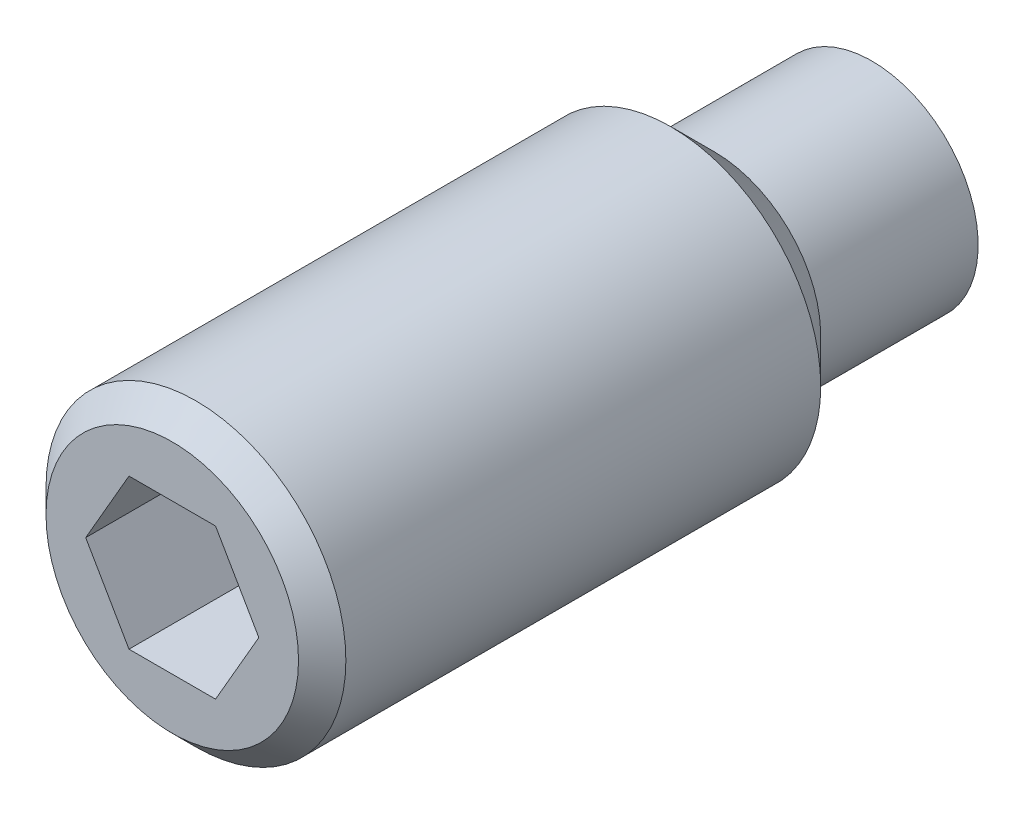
ISO-10303-21;
HEADER;
FILE_DESCRIPTION(('STEP AP214'),'2;1');
FILE_NAME('part.step','',(''),(''),'','','');
FILE_SCHEMA(('AUTOMOTIVE_DESIGN { 1 0 10303 214 1 1 1 1 }'));
ENDSEC;
DATA;
#1=APPLICATION_CONTEXT('core data for automotive mechanical design processes');
#2=APPLICATION_PROTOCOL_DEFINITION('international standard','automotive_design',2000,#1);
#3=PRODUCT_CONTEXT('',#1,'mechanical');
#4=PRODUCT('Part','Part','',(#3));
#5=PRODUCT_RELATED_PRODUCT_CATEGORY('part','',(#4));
#6=PRODUCT_DEFINITION_FORMATION('','',#4);
#7=PRODUCT_DEFINITION_CONTEXT('part definition',#1,'design');
#8=PRODUCT_DEFINITION('design','',#6,#7);
#9=PRODUCT_DEFINITION_SHAPE('','',#8);
#10=(LENGTH_UNIT() NAMED_UNIT(*) SI_UNIT(.MILLI.,.METRE.));
#11=(NAMED_UNIT(*) PLANE_ANGLE_UNIT() SI_UNIT($,.RADIAN.));
#12=(NAMED_UNIT(*) SI_UNIT($,.STERADIAN.) SOLID_ANGLE_UNIT());
#13=UNCERTAINTY_MEASURE_WITH_UNIT(LENGTH_MEASURE(1.E-05),#10,'distance_accuracy_value','');
#14=(GEOMETRIC_REPRESENTATION_CONTEXT(3) GLOBAL_UNCERTAINTY_ASSIGNED_CONTEXT((#13)) GLOBAL_UNIT_ASSIGNED_CONTEXT((#10,
#11,#12)) REPRESENTATION_CONTEXT('',''));
#15=CARTESIAN_POINT('',(0.,0.,0.));
#16=DIRECTION('',(0.,0.,1.));
#17=DIRECTION('',(1.,0.,0.));
#18=AXIS2_PLACEMENT_3D('',#15,#16,#17);
#19=CARTESIAN_POINT('',(0.,0.,-7.98800000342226));
#20=DIRECTION('',(0.,0.,1.));
#21=DIRECTION('',(1.,0.,0.));
#22=AXIS2_PLACEMENT_3D('',#19,#20,#21);
#23=CONICAL_SURFACE('',#22,3.48488459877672,1.04719755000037);
#24=CARTESIAN_POINT('',(3.46410000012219,8.40244162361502E-10,-7.9999999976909));
#25=CARTESIAN_POINT('',(3.38798689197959,0.131831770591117,-8.04395665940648));
#26=CARTESIAN_POINT('',(3.31121677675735,0.264801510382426,-8.08393294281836));
#27=CARTESIAN_POINT('',(3.15634732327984,0.533043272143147,-8.15371034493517));
#28=CARTESIAN_POINT('',(3.07824523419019,0.668320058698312,-8.18348678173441));
#29=CARTESIAN_POINT('',(2.92300893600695,0.937197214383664,-8.22983595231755));
#30=CARTESIAN_POINT('',(2.84589860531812,1.07075622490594,-8.2467172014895));
#31=CARTESIAN_POINT('',(2.69131530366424,1.33850235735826,-8.26686612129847));
#32=CARTESIAN_POINT('',(2.61384289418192,1.47268850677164,-8.27015048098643));
#33=CARTESIAN_POINT('',(2.46909400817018,1.72340093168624,-8.2633004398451));
#34=CARTESIAN_POINT('',(2.40179581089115,1.83996482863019,-8.25484795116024));
#35=CARTESIAN_POINT('',(2.26763784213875,2.07233324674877,-8.22806394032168));
#36=CARTESIAN_POINT('',(2.20077853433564,2.18813696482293,-8.20972327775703));
#37=CARTESIAN_POINT('',(2.06634418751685,2.42098408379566,-8.16387517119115));
#38=CARTESIAN_POINT('',(1.9987861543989,2.53799802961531,-8.13617347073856));
#39=CARTESIAN_POINT('',(1.8646774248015,2.7702811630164,-8.07330232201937));
#40=CARTESIAN_POINT('',(1.79812501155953,2.88555332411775,-8.03814763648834));
#41=CARTESIAN_POINT('',(1.73205000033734,2.99999860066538,-7.99999999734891));
#42=B_SPLINE_CURVE_WITH_KNOTS('',3,(#24,#25,#26,#27,#28,#29,#30,#31,#32,#33,#34,#35,#36,#37,#38,
#39,#40,#41),.UNSPECIFIED.,.F.,.F.,(4,2,2,2,2,2,2,2,4),(0.,0.475523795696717,0.95219028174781,
1.41706074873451,1.88136045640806,2.28556060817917,2.69013503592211,3.10368098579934,
3.51641531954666),.UNSPECIFIED.);
#43=CARTESIAN_POINT('',(3.46409999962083,0.,-7.99999999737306));
#44=VERTEX_POINT('',#43);
#45=CARTESIAN_POINT('',(1.73204999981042,2.99999860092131,-7.99999999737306));
#46=VERTEX_POINT('',#45);
#47=EDGE_CURVE('E135',#44,#46,#42,.T.);
#48=ORIENTED_EDGE('',*,*,#47,.T.);
#49=CARTESIAN_POINT('',(1.73204999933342,2.99999860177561,-7.9999999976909));
#50=CARTESIAN_POINT('',(1.58986586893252,2.99999860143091,-8.04104931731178));
#51=CARTESIAN_POINT('',(1.44655693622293,2.99999860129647,-8.07863112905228));
#52=CARTESIAN_POINT('',(1.15761111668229,2.99999860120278,-8.14505231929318));
#53=CARTESIAN_POINT('',(1.01196977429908,2.99999860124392,-8.17387213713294));
#54=CARTESIAN_POINT('',(0.72232131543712,2.9999986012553,-8.22021789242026));
#55=CARTESIAN_POINT('',(0.578354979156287,2.99999860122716,-8.237990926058));
#56=CARTESIAN_POINT('',(0.289591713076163,2.99999860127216,-8.26185016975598));
#57=CARTESIAN_POINT('',(0.144795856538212,2.99999860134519,-8.26794906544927));
#58=CARTESIAN_POINT('',(-0.144795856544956,2.99999860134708,-8.26794906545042));
#59=CARTESIAN_POINT('',(-0.289591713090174,2.99999860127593,-8.26185016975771));
#60=CARTESIAN_POINT('',(-0.578354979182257,2.99999860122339,-8.23799092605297));
#61=CARTESIAN_POINT('',(-0.722321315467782,2.99999860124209,-8.22021789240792));
#62=CARTESIAN_POINT('',(-1.01196977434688,2.99999860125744,-8.17387213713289));
#63=CARTESIAN_POINT('',(-1.15761111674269,2.99999860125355,-8.14505231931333));
#64=CARTESIAN_POINT('',(-1.44655693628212,2.99999860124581,-8.07863112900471));
#65=CARTESIAN_POINT('',(-1.58986586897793,2.99999860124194,-8.04104931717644));
#66=CARTESIAN_POINT('',(-1.73204999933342,2.99999860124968,-7.99999999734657));
#67=B_SPLINE_CURVE_WITH_KNOTS('',3,(#49,#50,#51,#52,#53,#54,#55,#56,#57,#58,#59,#60,#61,#62,#63,
#64,#65,#66),.UNSPECIFIED.,.F.,.F.,(4,2,2,2,2,2,2,2,4),(0.,0.444109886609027,0.889204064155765,
1.3239456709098,1.75821459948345,2.19248352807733,2.62722513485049,3.07231931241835,
3.51642919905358),.UNSPECIFIED.);
#68=CARTESIAN_POINT('',(-1.73204999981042,2.99999860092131,-7.99999999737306));
#69=VERTEX_POINT('',#68);
#70=EDGE_CURVE('E151',#46,#69,#67,.T.);
#71=ORIENTED_EDGE('',*,*,#70,.T.);
#72=CARTESIAN_POINT('',(-1.73205000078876,2.99999860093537,-7.9999999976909));
#73=CARTESIAN_POINT('',(-1.80816310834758,2.86816683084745,-8.04395665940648));
#74=CARTESIAN_POINT('',(-1.88493322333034,2.73519709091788,-8.08393294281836));
#75=CARTESIAN_POINT('',(-2.03980267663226,2.46695532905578,-8.15371034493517));
#76=CARTESIAN_POINT('',(-2.11790476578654,2.33167854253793,-8.18348678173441));
#77=CARTESIAN_POINT('',(-2.27314106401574,2.06280138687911,-8.22983595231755));
#78=CARTESIAN_POINT('',(-2.35025139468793,1.92924237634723,-8.2467172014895));
#79=CARTESIAN_POINT('',(-2.50483469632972,1.66149624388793,-8.26686612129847));
#80=CARTESIAN_POINT('',(-2.58230710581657,1.52731009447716,-8.27015048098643));
#81=CARTESIAN_POINT('',(-2.72705599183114,1.2765976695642,-8.2633004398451));
#82=CARTESIAN_POINT('',(-2.7943541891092,1.16003377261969,-8.25484795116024));
#83=CARTESIAN_POINT('',(-2.92851215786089,0.927665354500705,-8.22806394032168));
#84=CARTESIAN_POINT('',(-2.99537146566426,0.811861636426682,-8.20972327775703));
#85=CARTESIAN_POINT('',(-3.12980581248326,0.579014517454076,-8.16387517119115));
#86=CARTESIAN_POINT('',(-3.19736384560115,0.4620005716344,-8.13617347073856));
#87=CARTESIAN_POINT('',(-3.33147257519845,0.229717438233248,-8.07330232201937));
#88=CARTESIAN_POINT('',(-3.39802498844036,0.114445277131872,-8.03814763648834));
#89=CARTESIAN_POINT('',(-3.46409999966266,5.84295129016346E-10,-7.99999999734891));
#90=B_SPLINE_CURVE_WITH_KNOTS('',3,(#72,#73,#74,#75,#76,#77,#78,#79,#80,#81,#82,#83,#84,#85,#86,
#87,#88,#89),.UNSPECIFIED.,.F.,.F.,(4,2,2,2,2,2,2,2,4),(0.,0.475523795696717,0.95219028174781,
1.41706074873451,1.88136045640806,2.28556060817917,2.69013503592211,3.10368098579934,
3.51641531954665),.UNSPECIFIED.);
#91=CARTESIAN_POINT('',(-3.46409999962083,0.,-7.99999999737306));
#92=VERTEX_POINT('',#91);
#93=EDGE_CURVE('E158',#69,#92,#90,.T.);
#94=ORIENTED_EDGE('',*,*,#93,.T.);
#95=CARTESIAN_POINT('',(-3.46410000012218,-8.40242856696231E-10,-7.9999999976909));
#96=CARTESIAN_POINT('',(-3.38798689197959,-0.131831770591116,-8.04395665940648));
#97=CARTESIAN_POINT('',(-3.31121677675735,-0.264801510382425,-8.08393294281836));
#98=CARTESIAN_POINT('',(-3.15634732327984,-0.533043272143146,-8.15371034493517));
#99=CARTESIAN_POINT('',(-3.07824523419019,-0.668320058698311,-8.18348678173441));
#100=CARTESIAN_POINT('',(-2.92300893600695,-0.937197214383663,-8.22983595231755));
#101=CARTESIAN_POINT('',(-2.84589860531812,-1.07075622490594,-8.2467172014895));
#102=CARTESIAN_POINT('',(-2.69131530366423,-1.33850235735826,-8.26686612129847));
#103=CARTESIAN_POINT('',(-2.61384289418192,-1.47268850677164,-8.27015048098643));
#104=CARTESIAN_POINT('',(-2.46909400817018,-1.72340093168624,-8.2633004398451));
#105=CARTESIAN_POINT('',(-2.40179581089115,-1.83996482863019,-8.25484795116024));
#106=CARTESIAN_POINT('',(-2.26763784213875,-2.07233324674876,-8.22806394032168));
#107=CARTESIAN_POINT('',(-2.20077853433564,-2.18813696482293,-8.20972327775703));
#108=CARTESIAN_POINT('',(-2.06634418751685,-2.42098408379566,-8.16387517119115));
#109=CARTESIAN_POINT('',(-1.9987861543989,-2.5379980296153,-8.13617347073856));
#110=CARTESIAN_POINT('',(-1.8646774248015,-2.7702811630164,-8.07330232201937));
#111=CARTESIAN_POINT('',(-1.79812501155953,-2.88555332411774,-8.03814763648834));
#112=CARTESIAN_POINT('',(-1.73205000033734,-2.99999860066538,-7.99999999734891));
#113=B_SPLINE_CURVE_WITH_KNOTS('',3,(#95,#96,#97,#98,#99,#100,#101,#102,#103,#104,#105,#106,
#107,#108,#109,#110,#111,#112),.UNSPECIFIED.,.F.,.F.,(4,2,2,2,2,2,2,2,4),(0.,0.475523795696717,
0.95219028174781,1.41706074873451,1.88136045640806,2.28556060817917,2.69013503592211,
3.10368098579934,3.51641531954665),.UNSPECIFIED.);
#114=CARTESIAN_POINT('',(-1.73204999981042,-2.99999860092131,-7.99999999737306));
#115=VERTEX_POINT('',#114);
#116=EDGE_CURVE('E163',#92,#115,#113,.T.);
#117=ORIENTED_EDGE('',*,*,#116,.T.);
#118=CARTESIAN_POINT('',(-1.73204999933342,-2.99999860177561,-7.9999999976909));
#119=CARTESIAN_POINT('',(-1.58986586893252,-2.99999860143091,-8.04104931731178));
#120=CARTESIAN_POINT('',(-1.44655693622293,-2.99999860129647,-8.07863112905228));
#121=CARTESIAN_POINT('',(-1.15761111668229,-2.99999860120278,-8.14505231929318));
#122=CARTESIAN_POINT('',(-1.01196977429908,-2.99999860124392,-8.17387213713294));
#123=CARTESIAN_POINT('',(-0.722321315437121,-2.9999986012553,-8.22021789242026));
#124=CARTESIAN_POINT('',(-0.578354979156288,-2.99999860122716,-8.237990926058));
#125=CARTESIAN_POINT('',(-0.289591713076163,-2.99999860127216,-8.26185016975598));
#126=CARTESIAN_POINT('',(-0.144795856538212,-2.99999860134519,-8.26794906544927));
#127=CARTESIAN_POINT('',(0.144795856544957,-2.99999860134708,-8.26794906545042));
#128=CARTESIAN_POINT('',(0.289591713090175,-2.99999860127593,-8.26185016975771));
#129=CARTESIAN_POINT('',(0.578354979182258,-2.99999860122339,-8.23799092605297));
#130=CARTESIAN_POINT('',(0.722321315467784,-2.99999860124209,-8.22021789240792));
#131=CARTESIAN_POINT('',(1.01196977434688,-2.99999860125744,-8.17387213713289));
#132=CARTESIAN_POINT('',(1.1576111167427,-2.99999860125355,-8.14505231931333));
#133=CARTESIAN_POINT('',(1.44655693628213,-2.9999986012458,-8.07863112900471));
#134=CARTESIAN_POINT('',(1.58986586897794,-2.99999860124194,-8.04104931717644));
#135=CARTESIAN_POINT('',(1.73204999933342,-2.99999860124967,-7.99999999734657));
#136=B_SPLINE_CURVE_WITH_KNOTS('',3,(#118,#119,#120,#121,#122,#123,#124,#125,#126,#127,#128,
#129,#130,#131,#132,#133,#134,#135),.UNSPECIFIED.,.F.,.F.,(4,2,2,2,2,2,2,2,4),(0.,
0.444109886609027,0.889204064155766,1.3239456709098,1.75821459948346,2.19248352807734,
2.62722513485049,3.07231931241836,3.51642919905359),.UNSPECIFIED.);
#137=CARTESIAN_POINT('',(1.73204999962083,-2.99999860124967,-7.9999999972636));
#138=VERTEX_POINT('',#137);
#139=EDGE_CURVE('E20',#115,#138,#136,.T.);
#140=ORIENTED_EDGE('',*,*,#139,.T.);
#141=CARTESIAN_POINT('',(1.73205000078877,-2.99999860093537,-7.9999999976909));
#142=CARTESIAN_POINT('',(1.80816310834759,-2.86816683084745,-8.04395665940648));
#143=CARTESIAN_POINT('',(1.88493322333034,-2.73519709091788,-8.08393294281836));
#144=CARTESIAN_POINT('',(2.03980267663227,-2.46695532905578,-8.15371034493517));
#145=CARTESIAN_POINT('',(2.11790476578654,-2.33167854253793,-8.18348678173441));
#146=CARTESIAN_POINT('',(2.27314106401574,-2.06280138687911,-8.22983595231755));
#147=CARTESIAN_POINT('',(2.35025139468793,-1.92924237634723,-8.2467172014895));
#148=CARTESIAN_POINT('',(2.50483469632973,-1.66149624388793,-8.26686612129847));
#149=CARTESIAN_POINT('',(2.58230710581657,-1.52731009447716,-8.27015048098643));
#150=CARTESIAN_POINT('',(2.72705599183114,-1.2765976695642,-8.2633004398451));
#151=CARTESIAN_POINT('',(2.7943541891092,-1.16003377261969,-8.25484795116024));
#152=CARTESIAN_POINT('',(2.92851215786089,-0.927665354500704,-8.22806394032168));
#153=CARTESIAN_POINT('',(2.99537146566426,-0.811861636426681,-8.20972327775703));
#154=CARTESIAN_POINT('',(3.12980581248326,-0.579014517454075,-8.16387517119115));
#155=CARTESIAN_POINT('',(3.19736384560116,-0.462000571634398,-8.13617347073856));
#156=CARTESIAN_POINT('',(3.33147257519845,-0.229717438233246,-8.07330232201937));
#157=CARTESIAN_POINT('',(3.39802498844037,-0.11444527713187,-8.03814763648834));
#158=CARTESIAN_POINT('',(3.46409999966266,-5.84293970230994E-10,-7.99999999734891));
#159=B_SPLINE_CURVE_WITH_KNOTS('',3,(#141,#142,#143,#144,#145,#146,#147,#148,#149,#150,#151,
#152,#153,#154,#155,#156,#157,#158),.UNSPECIFIED.,.F.,.F.,(4,2,2,2,2,2,2,2,4),(0.,
0.475523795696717,0.952190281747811,1.41706074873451,1.88136045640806,2.28556060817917,
2.69013503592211,3.10368098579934,3.51641531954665),.UNSPECIFIED.);
#160=EDGE_CURVE('E91',#138,#44,#159,.T.);
#161=ORIENTED_EDGE('',*,*,#160,.T.);
#162=EDGE_LOOP('',(#48,#71,#94,#117,#140,#161));
#163=FACE_BOUND('',#162,.T.);
#164=CARTESIAN_POINT('',(0.,0.,-9.99999907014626));
#165=VERTEX_POINT('',#164);
#166=VERTEX_LOOP('',#165);
#167=FACE_BOUND('',#166,.T.);
#168=ADVANCED_FACE('F16',(#163,#167),#23,.F.);
#169=CARTESIAN_POINT('',(-1.73205,-2.99999860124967,0.));
#170=DIRECTION('',(0.,-1.,0.));
#171=DIRECTION('',(0.,0.,-1.));
#172=AXIS2_PLACEMENT_3D('',#169,#170,#171);
#173=PLANE('',#172);
#174=ORIENTED_EDGE('',*,*,#139,.F.);
#175=DIRECTION('',(0.,0.,1.));
#176=VECTOR('',#175,1.);
#177=CARTESIAN_POINT('',(-1.73205,-2.99999860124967,0.));
#178=LINE('',#177,#176);
#179=CARTESIAN_POINT('',(-1.73205,-2.99999860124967,0.));
#180=VERTEX_POINT('',#179);
#181=EDGE_CURVE('E85',#115,#180,#178,.T.);
#182=ORIENTED_EDGE('',*,*,#181,.T.);
#183=DIRECTION('',(1.,0.,0.));
#184=VECTOR('',#183,1.);
#185=CARTESIAN_POINT('',(0.,-2.99999860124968,0.));
#186=LINE('',#185,#184);
#187=CARTESIAN_POINT('',(1.73205,-2.99999860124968,0.));
#188=VERTEX_POINT('',#187);
#189=EDGE_CURVE('E79',#188,#180,#186,.F.);
#190=ORIENTED_EDGE('',*,*,#189,.F.);
#191=DIRECTION('',(0.,0.,1.));
#192=VECTOR('',#191,1.);
#193=CARTESIAN_POINT('',(1.73205,-2.99999860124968,0.));
#194=LINE('',#193,#192);
#195=EDGE_CURVE('E82',#188,#138,#194,.F.);
#196=ORIENTED_EDGE('',*,*,#195,.T.);
#197=EDGE_LOOP('',(#174,#182,#190,#196));
#198=FACE_BOUND('',#197,.T.);
#199=ADVANCED_FACE('F81',(#198),#173,.F.);
#200=CARTESIAN_POINT('',(-3.4641,0.,0.));
#201=DIRECTION('',(-0.866025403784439,-0.5,0.));
#202=DIRECTION('',(0.5,-0.866025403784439,0.));
#203=AXIS2_PLACEMENT_3D('',#200,#201,#202);
#204=PLANE('',#203);
#205=DIRECTION('',(0.,0.,1.));
#206=VECTOR('',#205,1.);
#207=CARTESIAN_POINT('',(-3.4641,0.,0.));
#208=LINE('',#207,#206);
#209=CARTESIAN_POINT('',(-3.4641,0.,0.));
#210=VERTEX_POINT('',#209);
#211=EDGE_CURVE('E167',#92,#210,#208,.T.);
#212=ORIENTED_EDGE('',*,*,#211,.T.);
#213=DIRECTION('',(-0.5,0.866025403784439,0.));
#214=VECTOR('',#213,1.);
#215=CARTESIAN_POINT('',(-1.73205,-2.99999860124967,0.));
#216=LINE('',#215,#214);
#217=EDGE_CURVE('E90',#180,#210,#216,.T.);
#218=ORIENTED_EDGE('',*,*,#217,.F.);
#219=ORIENTED_EDGE('',*,*,#181,.F.);
#220=ORIENTED_EDGE('',*,*,#116,.F.);
#221=EDGE_LOOP('',(#212,#218,#219,#220));
#222=FACE_BOUND('',#221,.T.);
#223=ADVANCED_FACE('F168',(#222),#204,.F.);
#224=CARTESIAN_POINT('',(-1.73205,2.99999860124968,0.));
#225=DIRECTION('',(-0.866025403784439,0.5,0.));
#226=DIRECTION('',(-0.5,-0.866025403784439,0.));
#227=AXIS2_PLACEMENT_3D('',#224,#225,#226);
#228=PLANE('',#227);
#229=DIRECTION('',(0.,0.,1.));
#230=VECTOR('',#229,1.);
#231=CARTESIAN_POINT('',(-1.73205,2.99999860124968,0.));
#232=LINE('',#231,#230);
#233=CARTESIAN_POINT('',(-1.73205,2.99999860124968,0.));
#234=VERTEX_POINT('',#233);
#235=EDGE_CURVE('E216',#69,#234,#232,.T.);
#236=ORIENTED_EDGE('',*,*,#235,.T.);
#237=DIRECTION('',(0.5,0.866025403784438,0.));
#238=VECTOR('',#237,1.);
#239=CARTESIAN_POINT('',(-3.4641,0.,0.));
#240=LINE('',#239,#238);
#241=EDGE_CURVE('E117',#210,#234,#240,.T.);
#242=ORIENTED_EDGE('',*,*,#241,.F.);
#243=ORIENTED_EDGE('',*,*,#211,.F.);
#244=ORIENTED_EDGE('',*,*,#93,.F.);
#245=EDGE_LOOP('',(#236,#242,#243,#244));
#246=FACE_BOUND('',#245,.T.);
#247=ADVANCED_FACE('F171',(#246),#228,.F.);
#248=CARTESIAN_POINT('',(1.73205,2.99999860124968,0.));
#249=DIRECTION('',(0.,1.,0.));
#250=DIRECTION('',(0.,0.,1.));
#251=AXIS2_PLACEMENT_3D('',#248,#249,#250);
#252=PLANE('',#251);
#253=ORIENTED_EDGE('',*,*,#70,.F.);
#254=DIRECTION('',(0.,0.,1.));
#255=VECTOR('',#254,1.);
#256=CARTESIAN_POINT('',(1.73205,2.99999860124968,0.));
#257=LINE('',#256,#255);
#258=CARTESIAN_POINT('',(1.73205,2.99999860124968,0.));
#259=VERTEX_POINT('',#258);
#260=EDGE_CURVE('E212',#46,#259,#257,.T.);
#261=ORIENTED_EDGE('',*,*,#260,.T.);
#262=DIRECTION('',(1.,0.,0.));
#263=VECTOR('',#262,1.);
#264=CARTESIAN_POINT('',(0.,2.99999860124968,0.));
#265=LINE('',#264,#263);
#266=EDGE_CURVE('E107',#234,#259,#265,.T.);
#267=ORIENTED_EDGE('',*,*,#266,.F.);
#268=ORIENTED_EDGE('',*,*,#235,.F.);
#269=EDGE_LOOP('',(#253,#261,#267,#268));
#270=FACE_BOUND('',#269,.T.);
#271=ADVANCED_FACE('F175',(#270),#252,.F.);
#272=CARTESIAN_POINT('',(3.4641,0.,0.));
#273=DIRECTION('',(0.866025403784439,0.5,0.));
#274=DIRECTION('',(-0.5,0.866025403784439,0.));
#275=AXIS2_PLACEMENT_3D('',#272,#273,#274);
#276=PLANE('',#275);
#277=DIRECTION('',(0.,0.,1.));
#278=VECTOR('',#277,1.);
#279=CARTESIAN_POINT('',(3.4641,0.,0.));
#280=LINE('',#279,#278);
#281=CARTESIAN_POINT('',(3.4641,0.,0.));
#282=VERTEX_POINT('',#281);
#283=EDGE_CURVE('E40',#44,#282,#280,.T.);
#284=ORIENTED_EDGE('',*,*,#283,.T.);
#285=DIRECTION('',(0.5,-0.866025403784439,0.));
#286=VECTOR('',#285,1.);
#287=CARTESIAN_POINT('',(1.73205,2.99999860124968,0.));
#288=LINE('',#287,#286);
#289=EDGE_CURVE('E101',#259,#282,#288,.T.);
#290=ORIENTED_EDGE('',*,*,#289,.F.);
#291=ORIENTED_EDGE('',*,*,#260,.F.);
#292=ORIENTED_EDGE('',*,*,#47,.F.);
#293=EDGE_LOOP('',(#284,#290,#291,#292));
#294=FACE_BOUND('',#293,.T.);
#295=ADVANCED_FACE('F179',(#294),#276,.F.);
#296=CARTESIAN_POINT('',(1.73205,-2.99999860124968,0.));
#297=DIRECTION('',(0.866025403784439,-0.5,0.));
#298=DIRECTION('',(0.5,0.866025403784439,0.));
#299=AXIS2_PLACEMENT_3D('',#296,#297,#298);
#300=PLANE('',#299);
#301=ORIENTED_EDGE('',*,*,#195,.F.);
#302=DIRECTION('',(-0.5,-0.866025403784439,0.));
#303=VECTOR('',#302,1.);
#304=CARTESIAN_POINT('',(3.4641,0.,0.));
#305=LINE('',#304,#303);
#306=EDGE_CURVE('E95',#282,#188,#305,.T.);
#307=ORIENTED_EDGE('',*,*,#306,.F.);
#308=ORIENTED_EDGE('',*,*,#283,.F.);
#309=ORIENTED_EDGE('',*,*,#160,.F.);
#310=EDGE_LOOP('',(#301,#307,#308,#309));
#311=FACE_BOUND('',#310,.T.);
#312=ADVANCED_FACE('F94',(#311),#300,.F.);
#313=CARTESIAN_POINT('',(0.,2.125,-28.));
#314=DIRECTION('',(0.,0.,-1.));
#315=DIRECTION('',(-1.,0.,0.));
#316=AXIS2_PLACEMENT_3D('',#313,#314,#315);
#317=PLANE('',#316);
#318=CARTESIAN_POINT('',(0.,0.,-28.));
#319=DIRECTION('',(0.,0.,-1.));
#320=DIRECTION('',(-1.,0.,0.));
#321=AXIS2_PLACEMENT_3D('',#318,#319,#320);
#322=CIRCLE('',#321,4.25);
#323=CARTESIAN_POINT('',(-4.25,0.,-28.));
#324=VERTEX_POINT('',#323);
#325=EDGE_CURVE('E102',#324,#324,#322,.F.);
#326=ORIENTED_EDGE('',*,*,#325,.F.);
#327=EDGE_LOOP('',(#326));
#328=FACE_BOUND('',#327,.T.);
#329=ADVANCED_FACE('F186',(#328),#317,.T.);
#330=CARTESIAN_POINT('',(0.,2.52640625,0.));
#331=DIRECTION('',(0.,0.,1.));
#332=DIRECTION('',(1.,0.,0.));
#333=AXIS2_PLACEMENT_3D('',#330,#331,#332);
#334=PLANE('',#333);
#335=ORIENTED_EDGE('',*,*,#289,.T.);
#336=ORIENTED_EDGE('',*,*,#306,.T.);
#337=ORIENTED_EDGE('',*,*,#189,.T.);
#338=ORIENTED_EDGE('',*,*,#217,.T.);
#339=ORIENTED_EDGE('',*,*,#241,.T.);
#340=ORIENTED_EDGE('',*,*,#266,.T.);
#341=EDGE_LOOP('',(#335,#336,#337,#338,#339,#340));
#342=FACE_BOUND('',#341,.T.);
#343=CARTESIAN_POINT('',(0.,0.,4.54747350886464E-10));
#344=DIRECTION('',(0.,0.,-1.));
#345=DIRECTION('',(-1.,0.,0.));
#346=AXIS2_PLACEMENT_3D('',#343,#344,#345);
#347=CIRCLE('',#346,5.05281250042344);
#348=CARTESIAN_POINT('',(-5.05281250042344,0.,4.54747031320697E-10));
#349=VERTEX_POINT('',#348);
#350=EDGE_CURVE('E105',#349,#349,#347,.T.);
#351=ORIENTED_EDGE('',*,*,#350,.F.);
#352=EDGE_LOOP('',(#351));
#353=FACE_BOUND('',#352,.T.);
#354=ADVANCED_FACE('F98',(#342,#353),#334,.T.);
#355=CARTESIAN_POINT('',(0.,0.,-24.85));
#356=DIRECTION('',(0.,0.,-1.));
#357=DIRECTION('',(-1.,0.,0.));
#358=AXIS2_PLACEMENT_3D('',#355,#356,#357);
#359=CYLINDRICAL_SURFACE('',#358,4.25);
#360=CARTESIAN_POINT('',(0.,0.,-21.7000000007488));
#361=DIRECTION('',(0.,0.,1.));
#362=DIRECTION('',(0.,1.,0.));
#363=AXIS2_PLACEMENT_3D('',#360,#361,#362);
#364=CIRCLE('',#363,4.250000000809);
#365=CARTESIAN_POINT('',(0.,4.250000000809,-21.7000000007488));
#366=VERTEX_POINT('',#365);
#367=EDGE_CURVE('E128',#366,#366,#364,.T.);
#368=ORIENTED_EDGE('',*,*,#367,.F.);
#369=EDGE_LOOP('',(#368));
#370=FACE_BOUND('',#369,.T.);
#371=ORIENTED_EDGE('',*,*,#325,.T.);
#372=EDGE_LOOP('',(#371));
#373=FACE_BOUND('',#372,.T.);
#374=ADVANCED_FACE('F232',(#370,#373),#359,.T.);
#375=CARTESIAN_POINT('',(0.,0.,-0.947187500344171));
#376=DIRECTION('',(0.,0.,-1.));
#377=DIRECTION('',(-1.,0.,0.));
#378=AXIS2_PLACEMENT_3D('',#375,#376,#377);
#379=CONICAL_SURFACE('',#378,5.99999999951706,0.785398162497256);
#380=ORIENTED_EDGE('',*,*,#350,.T.);
#381=EDGE_LOOP('',(#380));
#382=FACE_BOUND('',#381,.T.);
#383=CARTESIAN_POINT('',(0.,0.,-0.947187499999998));
#384=DIRECTION('',(0.,0.,-1.));
#385=DIRECTION('',(-1.,0.,0.));
#386=AXIS2_PLACEMENT_3D('',#383,#384,#385);
#387=CIRCLE('',#386,6.);
#388=CARTESIAN_POINT('',(-6.,0.,-0.947187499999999));
#389=VERTEX_POINT('',#388);
#390=EDGE_CURVE('E31',#389,#389,#387,.T.);
#391=ORIENTED_EDGE('',*,*,#390,.F.);
#392=EDGE_LOOP('',(#391));
#393=FACE_BOUND('',#392,.T.);
#394=ADVANCED_FACE('F192',(#382,#393),#379,.T.);
#395=CARTESIAN_POINT('',(0.,0.,-19.9499999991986));
#396=DIRECTION('',(0.,0.,1.));
#397=DIRECTION('',(1.,0.,0.));
#398=AXIS2_PLACEMENT_3D('',#395,#396,#397);
#399=CONICAL_SURFACE('',#398,5.99999999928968,0.785398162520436);
#400=CARTESIAN_POINT('',(0.,0.,-19.95));
#401=DIRECTION('',(0.,0.,-1.));
#402=DIRECTION('',(-1.,0.,0.));
#403=AXIS2_PLACEMENT_3D('',#400,#401,#402);
#404=CIRCLE('',#403,6.);
#405=CARTESIAN_POINT('',(-6.,0.,-19.95));
#406=VERTEX_POINT('',#405);
#407=EDGE_CURVE('E10',#406,#406,#404,.F.);
#408=ORIENTED_EDGE('',*,*,#407,.F.);
#409=EDGE_LOOP('',(#408));
#410=FACE_BOUND('',#409,.T.);
#411=ORIENTED_EDGE('',*,*,#367,.T.);
#412=EDGE_LOOP('',(#411));
#413=FACE_BOUND('',#412,.T.);
#414=ADVANCED_FACE('F188',(#410,#413),#399,.T.);
#415=CARTESIAN_POINT('',(0.,0.,-10.44859375));
#416=DIRECTION('',(0.,0.,-1.));
#417=DIRECTION('',(-1.,0.,0.));
#418=AXIS2_PLACEMENT_3D('',#415,#416,#417);
#419=CYLINDRICAL_SURFACE('',#418,6.);
#420=ORIENTED_EDGE('',*,*,#390,.T.);
#421=EDGE_LOOP('',(#420));
#422=FACE_BOUND('',#421,.T.);
#423=ORIENTED_EDGE('',*,*,#407,.T.);
#424=EDGE_LOOP('',(#423));
#425=FACE_BOUND('',#424,.T.);
#426=ADVANCED_FACE('F18',(#422,#425),#419,.T.);
#427=CLOSED_SHELL('',(#168,#199,#223,#247,#271,#295,#312,#329,#354,#374,#394,#414,#426));
#428=MANIFOLD_SOLID_BREP('B1',#427);
#429=ADVANCED_BREP_SHAPE_REPRESENTATION('',(#18,#428),#14);
#430=SHAPE_DEFINITION_REPRESENTATION(#9,#429);
ENDSEC;
END-ISO-10303-21;
